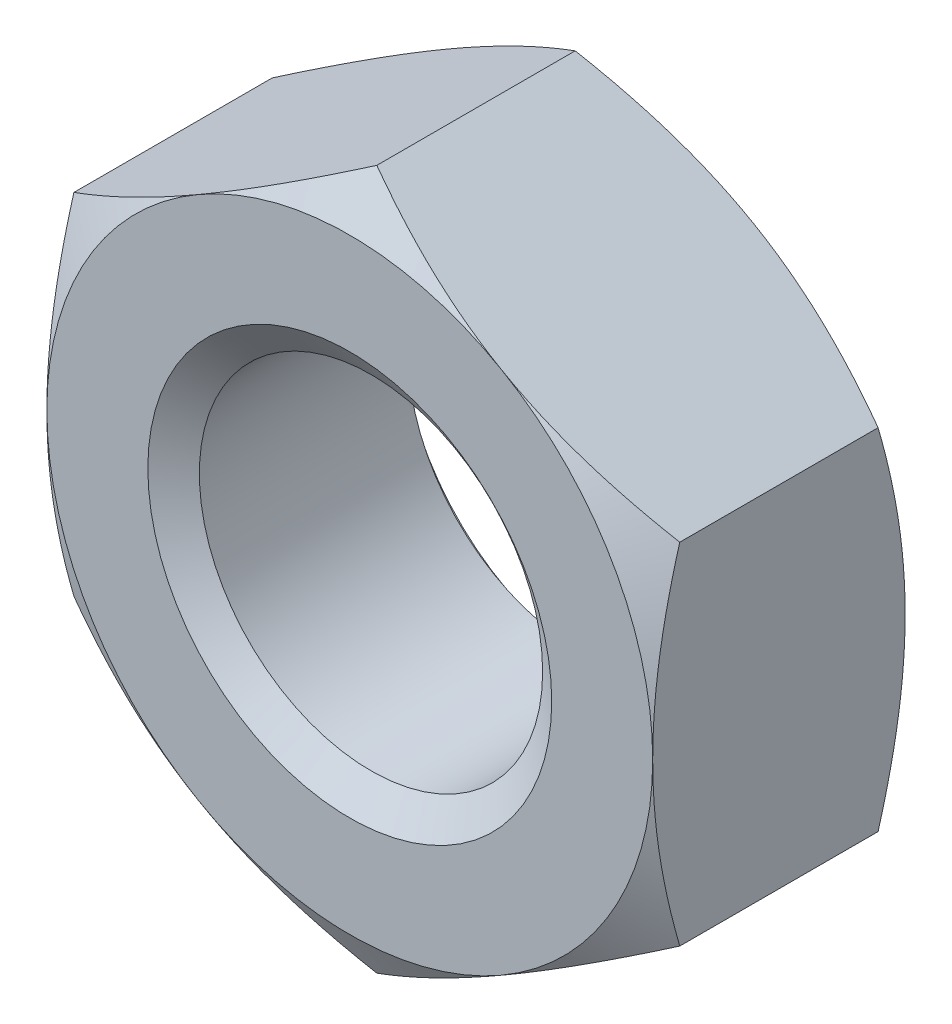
ISO-10303-21;
HEADER;
FILE_DESCRIPTION(('STEP AP214'),'2;1');
FILE_NAME('part.step','',(''),(''),'','','');
FILE_SCHEMA(('AUTOMOTIVE_DESIGN { 1 0 10303 214 1 1 1 1 }'));
ENDSEC;
DATA;
#1=APPLICATION_CONTEXT('core data for automotive mechanical design processes');
#2=APPLICATION_PROTOCOL_DEFINITION('international standard','automotive_design',2000,#1);
#3=PRODUCT_CONTEXT('',#1,'mechanical');
#4=PRODUCT('Part','Part','',(#3));
#5=PRODUCT_RELATED_PRODUCT_CATEGORY('part','',(#4));
#6=PRODUCT_DEFINITION_FORMATION('','',#4);
#7=PRODUCT_DEFINITION_CONTEXT('part definition',#1,'design');
#8=PRODUCT_DEFINITION('design','',#6,#7);
#9=PRODUCT_DEFINITION_SHAPE('','',#8);
#10=(LENGTH_UNIT() NAMED_UNIT(*) SI_UNIT(.MILLI.,.METRE.));
#11=(NAMED_UNIT(*) PLANE_ANGLE_UNIT() SI_UNIT($,.RADIAN.));
#12=(NAMED_UNIT(*) SI_UNIT($,.STERADIAN.) SOLID_ANGLE_UNIT());
#13=UNCERTAINTY_MEASURE_WITH_UNIT(LENGTH_MEASURE(1.E-05),#10,'distance_accuracy_value','');
#14=(GEOMETRIC_REPRESENTATION_CONTEXT(3) GLOBAL_UNCERTAINTY_ASSIGNED_CONTEXT((#13)) GLOBAL_UNIT_ASSIGNED_CONTEXT((#10,
#11,#12)) REPRESENTATION_CONTEXT('',''));
#15=CARTESIAN_POINT('',(0.,0.,0.));
#16=DIRECTION('',(0.,0.,1.));
#17=DIRECTION('',(1.,0.,0.));
#18=AXIS2_PLACEMENT_3D('',#15,#16,#17);
#19=CARTESIAN_POINT('',(-3.46944695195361E-13,-1.66533453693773E-13,-4.9999999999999));
#20=DIRECTION('',(0.,0.,1.));
#21=DIRECTION('',(1.00000000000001,0.,0.));
#22=AXIS2_PLACEMENT_3D('',#19,#20,#21);
#23=CYLINDRICAL_SURFACE('',#22,3.4);
#24=CARTESIAN_POINT('',(3.19189119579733E-13,-3.33066907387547E-13,-0.420124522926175));
#25=DIRECTION('',(0.,0.,1.));
#26=DIRECTION('',(1.00000000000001,0.,0.));
#27=AXIS2_PLACEMENT_3D('',#24,#25,#26);
#28=CIRCLE('',#27,3.4);
#29=CARTESIAN_POINT('',(3.40000000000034,-3.33255645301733E-13,-0.420124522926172));
#30=VERTEX_POINT('',#29);
#31=EDGE_CURVE('E174',#30,#30,#28,.F.);
#32=ORIENTED_EDGE('',*,*,#31,.F.);
#33=EDGE_LOOP('',(#32));
#34=FACE_BOUND('',#33,.T.);
#35=CARTESIAN_POINT('',(0.,0.,-4.55447547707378));
#36=DIRECTION('',(0.,0.,-1.));
#37=DIRECTION('',(-1.00000000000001,0.,0.));
#38=AXIS2_PLACEMENT_3D('',#35,#36,#37);
#39=CIRCLE('',#38,3.4);
#40=CARTESIAN_POINT('',(-3.40000000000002,0.,-4.55447547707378));
#41=VERTEX_POINT('',#40);
#42=EDGE_CURVE('E39',#41,#41,#39,.F.);
#43=ORIENTED_EDGE('',*,*,#42,.F.);
#44=EDGE_LOOP('',(#43));
#45=FACE_BOUND('',#44,.T.);
#46=ADVANCED_FACE('F34',(#34,#45),#23,.F.);
#47=CARTESIAN_POINT('',(0.,6.92820323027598,-4.99999999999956));
#48=DIRECTION('',(0.,0.,-1.));
#49=DIRECTION('',(-1.00000000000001,0.,0.));
#50=AXIS2_PLACEMENT_3D('',#47,#48,#49);
#51=PLANE('',#50);
#52=CARTESIAN_POINT('',(-3.46944695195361E-13,-1.66533453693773E-13,-4.9999999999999));
#53=DIRECTION('',(0.,0.,-1.));
#54=DIRECTION('',(-1.00000000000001,0.,0.));
#55=AXIS2_PLACEMENT_3D('',#52,#53,#54);
#56=CIRCLE('',#55,6.);
#57=CARTESIAN_POINT('',(-6.00000000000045,8.88178419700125E-13,-4.99999999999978));
#58=VERTEX_POINT('',#57);
#59=CARTESIAN_POINT('',(-3.00000000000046,-5.19615242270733,-4.99999999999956));
#60=VERTEX_POINT('',#59);
#61=EDGE_CURVE('E170',#58,#60,#56,.F.);
#62=ORIENTED_EDGE('',*,*,#61,.F.);
#63=CARTESIAN_POINT('',(-3.00000000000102,5.19615242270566,-4.99999999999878));
#64=VERTEX_POINT('',#63);
#65=EDGE_CURVE('E152',#64,#58,#56,.F.);
#66=ORIENTED_EDGE('',*,*,#65,.F.);
#67=CARTESIAN_POINT('',(2.99999999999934,5.19615242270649,-4.99999999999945));
#68=VERTEX_POINT('',#67);
#69=EDGE_CURVE('E169',#68,#64,#56,.F.);
#70=ORIENTED_EDGE('',*,*,#69,.F.);
#71=CARTESIAN_POINT('',(-3.46944695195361E-13,-1.66533453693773E-13,-4.9999999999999));
#72=DIRECTION('',(0.,0.,1.));
#73=DIRECTION('',(1.00000000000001,0.,0.));
#74=AXIS2_PLACEMENT_3D('',#71,#72,#73);
#75=CIRCLE('',#74,6.);
#76=CARTESIAN_POINT('',(6.,-1.11022302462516E-13,-4.99999999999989));
#77=VERTEX_POINT('',#76);
#78=EDGE_CURVE('E244',#77,#68,#75,.T.);
#79=ORIENTED_EDGE('',*,*,#78,.F.);
#80=CARTESIAN_POINT('',(3.0000000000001,-5.1961524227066,-4.9999999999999));
#81=VERTEX_POINT('',#80);
#82=EDGE_CURVE('E360',#81,#77,#56,.F.);
#83=ORIENTED_EDGE('',*,*,#82,.F.);
#84=EDGE_CURVE('E364',#60,#81,#56,.F.);
#85=ORIENTED_EDGE('',*,*,#84,.F.);
#86=EDGE_LOOP('',(#62,#66,#70,#79,#83,#85));
#87=FACE_BOUND('',#86,.T.);
#88=CARTESIAN_POINT('',(-3.46944695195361E-13,-1.66533453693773E-13,-4.9999999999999));
#89=DIRECTION('',(0.,0.,-1.));
#90=DIRECTION('',(-1.00000000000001,0.,0.));
#91=AXIS2_PLACEMENT_3D('',#88,#89,#90);
#92=CIRCLE('',#91,4.);
#93=CARTESIAN_POINT('',(-4.00000000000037,-1.66311409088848E-13,-4.9999999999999));
#94=VERTEX_POINT('',#93);
#95=EDGE_CURVE('E177',#94,#94,#92,.F.);
#96=ORIENTED_EDGE('',*,*,#95,.T.);
#97=EDGE_LOOP('',(#96));
#98=FACE_BOUND('',#97,.T.);
#99=ADVANCED_FACE('F297',(#87,#98),#51,.T.);
#100=CARTESIAN_POINT('',(-2.35922392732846E-13,6.9282032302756,7.70217223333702E-13));
#101=DIRECTION('',(0.,0.,-1.));
#102=DIRECTION('',(-1.00000000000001,0.,0.));
#103=AXIS2_PLACEMENT_3D('',#100,#101,#102);
#104=PLANE('',#103);
#105=CARTESIAN_POINT('',(0.,0.,0.));
#106=DIRECTION('',(0.,0.,-1.));
#107=DIRECTION('',(-1.00000000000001,0.,0.));
#108=AXIS2_PLACEMENT_3D('',#105,#106,#107);
#109=CIRCLE('',#108,6.);
#110=CARTESIAN_POINT('',(-5.99999999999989,2.77555756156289E-13,6.66133814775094E-13));
#111=VERTEX_POINT('',#110);
#112=CARTESIAN_POINT('',(-3.00000000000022,5.19615242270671,4.44089209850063E-13));
#113=VERTEX_POINT('',#112);
#114=EDGE_CURVE('E11',#111,#113,#109,.T.);
#115=ORIENTED_EDGE('',*,*,#114,.F.);
#116=CARTESIAN_POINT('',(-3.,-5.19615242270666,0.));
#117=VERTEX_POINT('',#116);
#118=EDGE_CURVE('E46',#117,#111,#109,.T.);
#119=ORIENTED_EDGE('',*,*,#118,.F.);
#120=CARTESIAN_POINT('',(3.,-5.19615242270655,1.11022302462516E-13));
#121=VERTEX_POINT('',#120);
#122=EDGE_CURVE('E173',#121,#117,#109,.T.);
#123=ORIENTED_EDGE('',*,*,#122,.F.);
#124=CARTESIAN_POINT('',(5.99999999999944,6.66133814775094E-13,3.2612801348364E-13));
#125=VERTEX_POINT('',#124);
#126=EDGE_CURVE('E351',#125,#121,#109,.T.);
#127=ORIENTED_EDGE('',*,*,#126,.F.);
#128=CARTESIAN_POINT('',(0.,0.,0.));
#129=DIRECTION('',(0.,0.,1.));
#130=DIRECTION('',(1.00000000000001,0.,0.));
#131=AXIS2_PLACEMENT_3D('',#128,#129,#130);
#132=CIRCLE('',#131,6.);
#133=CARTESIAN_POINT('',(3.00000000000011,5.19615242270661,0.));
#134=VERTEX_POINT('',#133);
#135=EDGE_CURVE('E128',#125,#134,#132,.T.);
#136=ORIENTED_EDGE('',*,*,#135,.T.);
#137=EDGE_CURVE('E44',#113,#134,#109,.T.);
#138=ORIENTED_EDGE('',*,*,#137,.F.);
#139=EDGE_LOOP('',(#115,#119,#123,#127,#136,#138));
#140=FACE_BOUND('',#139,.T.);
#141=CARTESIAN_POINT('',(0.,0.,0.));
#142=DIRECTION('',(0.,0.,1.));
#143=DIRECTION('',(1.00000000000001,0.,0.));
#144=AXIS2_PLACEMENT_3D('',#141,#142,#143);
#145=CIRCLE('',#144,4.);
#146=CARTESIAN_POINT('',(4.00000000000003,0.,0.));
#147=VERTEX_POINT('',#146);
#148=EDGE_CURVE('E176',#147,#147,#145,.T.);
#149=ORIENTED_EDGE('',*,*,#148,.F.);
#150=EDGE_LOOP('',(#149));
#151=FACE_BOUND('',#150,.T.);
#152=ADVANCED_FACE('F249',(#140,#151),#104,.F.);
#153=CARTESIAN_POINT('',(0.,6.92820323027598,-4.99999999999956));
#154=DIRECTION('',(-0.500000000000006,0.866025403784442,0.));
#155=DIRECTION('',(-0.866025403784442,-0.500000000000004,0.));
#156=AXIS2_PLACEMENT_3D('',#153,#154,#155);
#157=PLANE('',#156);
#158=DIRECTION('',(0.,0.,1.));
#159=VECTOR('',#158,1.);
#160=CARTESIAN_POINT('',(-6.00000000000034,3.46410161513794,-4.99999999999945));
#161=LINE('',#160,#159);
#162=CARTESIAN_POINT('',(-6.00000000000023,3.46410161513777,-4.464101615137));
#163=VERTEX_POINT('',#162);
#164=CARTESIAN_POINT('',(-6.00000000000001,3.46410161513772,-0.535898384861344));
#165=VERTEX_POINT('',#164);
#166=EDGE_CURVE('E164',#163,#165,#161,.T.);
#167=ORIENTED_EDGE('',*,*,#166,.T.);
#168=CARTESIAN_POINT('',(-6.0002000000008,3.46398614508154,-0.535965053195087));
#169=CARTESIAN_POINT('',(-5.86831298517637,3.54013114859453,-0.49200899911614));
#170=CARTESIAN_POINT('',(-5.73593423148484,3.61656005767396,-0.450047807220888));
#171=CARTESIAN_POINT('',(-5.4701016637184,3.77003856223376,-0.370664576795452));
#172=CARTESIAN_POINT('',(-5.33664741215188,3.84708841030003,-0.333244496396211));
#173=CARTESIAN_POINT('',(-4.9341478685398,4.07947163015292,-0.228530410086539));
#174=CARTESIAN_POINT('',(-4.66351376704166,4.2357223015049,-0.16897005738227));
#175=CARTESIAN_POINT('',(-4.25851475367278,4.46954859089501,-0.0991282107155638));
#176=CARTESIAN_POINT('',(-4.1253599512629,4.54642555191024,-0.0792322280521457));
#177=CARTESIAN_POINT('',(-3.85844867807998,4.70052684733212,-0.0458694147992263));
#178=CARTESIAN_POINT('',(-3.72469226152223,4.77775115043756,-0.0324020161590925));
#179=CARTESIAN_POINT('',(-3.45694711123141,4.93233388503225,-0.0122395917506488));
#180=CARTESIAN_POINT('',(-3.32295881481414,5.00969206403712,-0.00553688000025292));
#181=CARTESIAN_POINT('',(-3.05486583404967,5.16447561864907,0.000959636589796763));
#182=CARTESIAN_POINT('',(-2.92076115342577,5.24190099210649,0.000753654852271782));
#183=CARTESIAN_POINT('',(-2.55335498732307,5.45402304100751,-0.00930718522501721));
#184=CARTESIAN_POINT('',(-2.32017376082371,5.58865028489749,-0.0261978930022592));
#185=CARTESIAN_POINT('',(-1.8553600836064,5.85701058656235,-0.079759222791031));
#186=CARTESIAN_POINT('',(-1.62372926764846,5.99074270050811,-0.116448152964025));
#187=CARTESIAN_POINT('',(-1.15798010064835,6.25964310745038,-0.208160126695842));
#188=CARTESIAN_POINT('',(-0.923920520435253,6.39477746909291,-0.263571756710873));
#189=CARTESIAN_POINT('',(-0.45929191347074,6.663030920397,-0.389333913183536));
#190=CARTESIAN_POINT('',(-0.228716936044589,6.79615344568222,-0.459654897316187));
#191=CARTESIAN_POINT('',(0.000200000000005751,6.92831870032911,-0.535965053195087));
#192=B_SPLINE_CURVE_WITH_KNOTS('',3,(#168,#169,#170,#171,#172,#173,#174,#175,#176,#177,#178,
#179,#180,#181,#182,#183,#184,#185,#186,#187,#188,#189,#190,#191),.UNSPECIFIED.,.F.,.F.,(4,2,2,
2,2,2,2,2,2,2,2,4),(0.,0.475482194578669,0.951168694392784,1.90451835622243,2.36951738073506,
2.83447530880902,3.29890435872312,3.76331906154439,4.57182194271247,5.38107376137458,
6.20827406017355,7.03385036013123),.UNSPECIFIED.);
#193=EDGE_CURVE('E133',#165,#113,#192,.T.);
#194=ORIENTED_EDGE('',*,*,#193,.T.);
#195=CARTESIAN_POINT('',(-1.11022302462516E-13,6.92820323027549,-0.535898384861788));
#196=VERTEX_POINT('',#195);
#197=EDGE_CURVE('E53',#113,#196,#192,.T.);
#198=ORIENTED_EDGE('',*,*,#197,.T.);
#199=DIRECTION('',(0.,0.,1.));
#200=VECTOR('',#199,1.);
#201=CARTESIAN_POINT('',(0.,6.92820323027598,-4.99999999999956));
#202=LINE('',#201,#200);
#203=CARTESIAN_POINT('',(-2.22044604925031E-13,6.92820323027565,-4.46410161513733));
#204=VERTEX_POINT('',#203);
#205=EDGE_CURVE('E149',#204,#196,#202,.T.);
#206=ORIENTED_EDGE('',*,*,#205,.F.);
#207=CARTESIAN_POINT('',(-6.00020000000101,3.46398614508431,-4.46403494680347));
#208=CARTESIAN_POINT('',(-5.86831298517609,3.54013114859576,-4.50799100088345));
#209=CARTESIAN_POINT('',(-5.73593423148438,3.61656005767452,-4.54995219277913));
#210=CARTESIAN_POINT('',(-5.47010166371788,3.77003856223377,-4.62933542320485));
#211=CARTESIAN_POINT('',(-5.33664741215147,3.84708841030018,-4.66675550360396));
#212=CARTESIAN_POINT('',(-4.93414786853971,4.07947163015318,-4.77146958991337));
#213=CARTESIAN_POINT('',(-4.6635137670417,4.23572230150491,-4.83102994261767));
#214=CARTESIAN_POINT('',(-4.25851475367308,4.46954859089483,-4.90087178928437));
#215=CARTESIAN_POINT('',(-4.12535995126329,4.54642555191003,-4.92076777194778));
#216=CARTESIAN_POINT('',(-3.85844867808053,4.7005268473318,-4.95413058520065));
#217=CARTESIAN_POINT('',(-3.72469226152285,4.77775115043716,-4.96759798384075));
#218=CARTESIAN_POINT('',(-3.45694711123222,4.93233388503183,-4.98776040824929));
#219=CARTESIAN_POINT('',(-3.32295881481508,5.00969206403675,-4.99446311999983));
#220=CARTESIAN_POINT('',(-3.0548658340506,5.16447561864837,-5.00095963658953));
#221=CARTESIAN_POINT('',(-2.92076115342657,5.24190099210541,-5.00075365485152));
#222=CARTESIAN_POINT('',(-2.55335498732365,5.45402304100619,-4.99069281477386));
#223=CARTESIAN_POINT('',(-2.32017376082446,5.58865028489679,-4.97380210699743));
#224=CARTESIAN_POINT('',(-1.85536008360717,5.85701058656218,-4.92024077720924));
#225=CARTESIAN_POINT('',(-1.62372926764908,5.99074270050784,-4.88355184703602));
#226=CARTESIAN_POINT('',(-1.15798010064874,6.25964310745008,-4.79183987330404));
#227=CARTESIAN_POINT('',(-0.923920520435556,6.39477746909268,-4.73642824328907));
#228=CARTESIAN_POINT('',(-0.459291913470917,6.66303092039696,-4.61066608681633));
#229=CARTESIAN_POINT('',(-0.228716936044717,6.7961534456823,-4.54034510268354));
#230=CARTESIAN_POINT('',(0.000199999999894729,6.92831870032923,-4.46403494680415));
#231=B_SPLINE_CURVE_WITH_KNOTS('',3,(#207,#208,#209,#210,#211,#212,#213,#214,#215,#216,#217,
#218,#219,#220,#221,#222,#223,#224,#225,#226,#227,#228,#229,#230),.UNSPECIFIED.,.F.,.F.,(4,2,2,
2,2,2,2,2,2,2,2,4),(0.,0.475482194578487,0.95116869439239,1.90451835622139,2.36951738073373,
2.8344753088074,3.29890435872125,3.76331906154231,4.57182194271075,5.38107376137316,
6.20827406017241,7.03385036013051),.UNSPECIFIED.);
#232=EDGE_CURVE('E167',#64,#204,#231,.T.);
#233=ORIENTED_EDGE('',*,*,#232,.F.);
#234=EDGE_CURVE('E259',#163,#64,#231,.T.);
#235=ORIENTED_EDGE('',*,*,#234,.F.);
#236=EDGE_LOOP('',(#167,#194,#198,#206,#233,#235));
#237=FACE_BOUND('',#236,.T.);
#238=ADVANCED_FACE('F36',(#237),#157,.T.);
#239=CARTESIAN_POINT('',(6.00000000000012,3.46410161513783,-4.99999999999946));
#240=DIRECTION('',(0.500000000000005,0.866025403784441,0.));
#241=DIRECTION('',(-0.866025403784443,0.500000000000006,0.));
#242=AXIS2_PLACEMENT_3D('',#239,#240,#241);
#243=PLANE('',#242);
#244=ORIENTED_EDGE('',*,*,#205,.T.);
#245=CARTESIAN_POINT('',(-0.000200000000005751,6.92831870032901,-0.535965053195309));
#246=CARTESIAN_POINT('',(0.131687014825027,6.85217369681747,-0.492008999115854));
#247=CARTESIAN_POINT('',(0.264065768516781,6.77574478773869,-0.450047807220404));
#248=CARTESIAN_POINT('',(0.529898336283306,6.62226628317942,-0.37066457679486));
#249=CARTESIAN_POINT('',(0.6633525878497,6.54521643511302,-0.333244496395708));
#250=CARTESIAN_POINT('',(1.06585213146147,6.31283321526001,-0.228530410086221));
#251=CARTESIAN_POINT('',(1.33648623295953,6.15658254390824,-0.168970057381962));
#252=CARTESIAN_POINT('',(1.74148524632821,5.92275625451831,-0.0991282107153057));
#253=CARTESIAN_POINT('',(1.87464004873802,5.84587929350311,-0.0792322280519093));
#254=CARTESIAN_POINT('',(2.14155132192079,5.69177799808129,-0.045869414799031));
#255=CARTESIAN_POINT('',(2.27530773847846,5.61455369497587,-0.0324020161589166));
#256=CARTESIAN_POINT('',(2.54305288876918,5.45997096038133,-0.0122395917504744));
#257=CARTESIAN_POINT('',(2.67704118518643,5.3826127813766,-0.00553688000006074));
#258=CARTESIAN_POINT('',(2.94513416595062,5.22782922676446,0.000959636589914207));
#259=CARTESIAN_POINT('',(3.07923884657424,5.15040385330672,0.00075365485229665));
#260=CARTESIAN_POINT('',(3.44664501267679,4.9382818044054,-0.00930718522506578));
#261=CARTESIAN_POINT('',(3.67982623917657,4.80365456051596,-0.0261978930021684));
#262=CARTESIAN_POINT('',(4.14463991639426,4.53529425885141,-0.0797592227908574));
#263=CARTESIAN_POINT('',(4.37627073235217,4.40156214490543,-0.116448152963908));
#264=CARTESIAN_POINT('',(4.84201989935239,4.13266173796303,-0.208160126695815));
#265=CARTESIAN_POINT('',(5.07607947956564,3.9975273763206,-0.26357175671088));
#266=CARTESIAN_POINT('',(5.54070808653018,3.7292739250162,-0.389333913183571));
#267=CARTESIAN_POINT('',(5.77128306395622,3.59615139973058,-0.459654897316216));
#268=CARTESIAN_POINT('',(6.00020000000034,3.46398614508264,-0.53596505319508));
#269=B_SPLINE_CURVE_WITH_KNOTS('',3,(#245,#246,#247,#248,#249,#250,#251,#252,#253,#254,#255,
#256,#257,#258,#259,#260,#261,#262,#263,#264,#265,#266,#267,#268),.UNSPECIFIED.,.F.,.F.,(4,2,2,
2,2,2,2,2,2,2,2,4),(0.,0.475482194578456,0.951168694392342,1.90451835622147,2.36951738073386,
2.83447530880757,3.29890435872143,3.76331906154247,4.57182194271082,5.38107376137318,
6.20827406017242,7.03385036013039),.UNSPECIFIED.);
#270=EDGE_CURVE('E143',#196,#134,#269,.T.);
#271=ORIENTED_EDGE('',*,*,#270,.T.);
#272=CARTESIAN_POINT('',(5.99999999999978,3.46410161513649,-0.535898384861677));
#273=VERTEX_POINT('',#272);
#274=EDGE_CURVE('E60',#134,#273,#269,.T.);
#275=ORIENTED_EDGE('',*,*,#274,.T.);
#276=DIRECTION('',(0.,0.,1.));
#277=VECTOR('',#276,1.);
#278=CARTESIAN_POINT('',(6.00000000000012,3.46410161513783,-4.99999999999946));
#279=LINE('',#278,#277);
#280=CARTESIAN_POINT('',(5.99999999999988,3.46410161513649,-4.46410161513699));
#281=VERTEX_POINT('',#280);
#282=EDGE_CURVE('E142',#281,#273,#279,.T.);
#283=ORIENTED_EDGE('',*,*,#282,.F.);
#284=CARTESIAN_POINT('',(-0.000200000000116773,6.92831870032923,-4.46403494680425));
#285=CARTESIAN_POINT('',(0.131687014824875,6.85217369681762,-4.50799100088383));
#286=CARTESIAN_POINT('',(0.26406576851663,6.7757447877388,-4.54995219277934));
#287=CARTESIAN_POINT('',(0.529898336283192,6.62226628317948,-4.62933542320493));
#288=CARTESIAN_POINT('',(0.663352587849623,6.54521643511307,-4.66675550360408));
#289=CARTESIAN_POINT('',(1.06585213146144,6.31283321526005,-4.77146958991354));
#290=CARTESIAN_POINT('',(1.3364862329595,6.15658254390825,-4.8310299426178));
#291=CARTESIAN_POINT('',(1.74148524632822,5.92275625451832,-4.90087178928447));
#292=CARTESIAN_POINT('',(1.87464004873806,5.84587929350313,-4.92076777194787));
#293=CARTESIAN_POINT('',(2.14155132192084,5.69177799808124,-4.95413058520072));
#294=CARTESIAN_POINT('',(2.2753077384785,5.61455369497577,-4.96759798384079));
#295=CARTESIAN_POINT('',(2.54305288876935,5.45997096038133,-4.98776040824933));
#296=CARTESIAN_POINT('',(2.67704118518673,5.38261278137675,-4.99446311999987));
#297=CARTESIAN_POINT('',(2.9451341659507,5.2278292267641,-5.00095963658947));
#298=CARTESIAN_POINT('',(3.07923884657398,5.15040385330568,-5.00075365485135));
#299=CARTESIAN_POINT('',(3.44664501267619,4.93828180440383,-4.99069281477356));
#300=CARTESIAN_POINT('',(3.67982623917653,4.80365456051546,-4.97380210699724));
#301=CARTESIAN_POINT('',(4.14463991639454,4.53529425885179,-4.92024077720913));
#302=CARTESIAN_POINT('',(4.37627073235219,4.40156214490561,-4.88355184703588));
#303=CARTESIAN_POINT('',(4.84201989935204,4.13266173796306,-4.79183987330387));
#304=CARTESIAN_POINT('',(5.07607947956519,3.99752737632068,-4.73642824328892));
#305=CARTESIAN_POINT('',(5.54070808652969,3.72927392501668,-4.61066608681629));
#306=CARTESIAN_POINT('',(5.77128306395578,3.59615139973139,-4.54034510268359));
#307=CARTESIAN_POINT('',(6.0002,3.46398614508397,-4.46403494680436));
#308=B_SPLINE_CURVE_WITH_KNOTS('',3,(#284,#285,#286,#287,#288,#289,#290,#291,#292,#293,#294,
#295,#296,#297,#298,#299,#300,#301,#302,#303,#304,#305,#306,#307),.UNSPECIFIED.,.F.,.F.,(4,2,2,
2,2,2,2,2,2,2,2,4),(0.,0.47548219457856,0.951168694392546,1.90451835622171,2.36951738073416,
2.83447530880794,3.2989043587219,3.76331906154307,4.57182194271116,5.38107376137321,
6.20827406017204,7.03385036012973),.UNSPECIFIED.);
#309=EDGE_CURVE('E253',#68,#281,#308,.T.);
#310=ORIENTED_EDGE('',*,*,#309,.F.);
#311=EDGE_CURVE('E258',#204,#68,#308,.T.);
#312=ORIENTED_EDGE('',*,*,#311,.F.);
#313=EDGE_LOOP('',(#244,#271,#275,#283,#310,#312));
#314=FACE_BOUND('',#313,.T.);
#315=ADVANCED_FACE('F140',(#314),#243,.T.);
#316=CARTESIAN_POINT('',(6.00000000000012,3.46410161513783,-4.99999999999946));
#317=DIRECTION('',(-1.00000000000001,0.,0.));
#318=DIRECTION('',(0.,-1.,0.));
#319=AXIS2_PLACEMENT_3D('',#316,#317,#318);
#320=PLANE('',#319);
#321=CARTESIAN_POINT('',(5.99999999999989,-9.18730798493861,-2.87116023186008));
#322=CARTESIAN_POINT('',(6.00000000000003,-8.92387405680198,-2.74385440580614));
#323=CARTESIAN_POINT('',(6.00000000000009,-8.65981728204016,-2.61781410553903));
#324=CARTESIAN_POINT('',(6.00000000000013,-8.13012127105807,-2.36898772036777));
#325=CARTESIAN_POINT('',(6.00000000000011,-7.86448177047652,-2.24620219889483));
#326=CARTESIAN_POINT('',(6.0000000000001,-7.32984857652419,-2.00396169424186));
#327=CARTESIAN_POINT('',(6.00000000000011,-7.06084438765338,-1.88452979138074));
#328=CARTESIAN_POINT('',(6.00000000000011,-6.52062501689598,-1.65079587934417));
#329=CARTESIAN_POINT('',(6.00000000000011,-6.24940995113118,-1.5364936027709));
#330=CARTESIAN_POINT('',(6.00000000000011,-5.70097061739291,-1.31302597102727));
#331=CARTESIAN_POINT('',(6.00000000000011,-5.4237134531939,-1.20394090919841));
#332=CARTESIAN_POINT('',(6.00000000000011,-4.86592864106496,-0.994314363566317));
#333=CARTESIAN_POINT('',(6.00000000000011,-4.58540063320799,-0.893773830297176));
#334=CARTESIAN_POINT('',(6.00000000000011,-4.02120500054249,-0.703937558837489));
#335=CARTESIAN_POINT('',(6.00000000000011,-3.73754550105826,-0.614617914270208));
#336=CARTESIAN_POINT('',(6.00000000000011,-3.16619097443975,-0.450125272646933));
#337=CARTESIAN_POINT('',(6.0000000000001,-2.8784972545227,-0.374947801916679));
#338=CARTESIAN_POINT('',(6.0000000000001,-2.29889164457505,-0.242385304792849));
#339=CARTESIAN_POINT('',(6.00000000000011,-2.00697865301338,-0.185005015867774));
#340=CARTESIAN_POINT('',(6.00000000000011,-1.41959231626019,-0.0919146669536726));
#341=CARTESIAN_POINT('',(6.00000000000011,-1.1241189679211,-0.0562046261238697));
#342=CARTESIAN_POINT('',(6.00000000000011,-0.680438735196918,-0.0211814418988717));
#343=CARTESIAN_POINT('',(6.00000000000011,-0.532926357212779,-0.0125955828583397));
#344=CARTESIAN_POINT('',(6.00000000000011,-0.23766360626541,-0.00167454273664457));
#345=CARTESIAN_POINT('',(6.00000000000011,-0.0899132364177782,0.000660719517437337));
#346=CARTESIAN_POINT('',(6.00000000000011,0.205509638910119,-0.000982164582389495));
#347=CARTESIAN_POINT('',(6.00000000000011,0.353182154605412,-0.00495853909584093));
#348=CARTESIAN_POINT('',(6.00000000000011,0.648231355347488,-0.0191239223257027));
#349=CARTESIAN_POINT('',(6.00000000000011,0.795608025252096,-0.0293132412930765));
#350=CARTESIAN_POINT('',(6.00000000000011,1.15280356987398,-0.0613263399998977));
#351=CARTESIAN_POINT('',(6.00000000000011,1.36234795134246,-0.0862632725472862));
#352=CARTESIAN_POINT('',(6.00000000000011,1.7798310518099,-0.147313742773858));
#353=CARTESIAN_POINT('',(6.00000000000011,1.987769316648,-0.183430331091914));
#354=CARTESIAN_POINT('',(6.00000000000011,2.40186856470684,-0.265559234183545));
#355=CARTESIAN_POINT('',(6.00000000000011,2.60802767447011,-0.31158090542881));
#356=CARTESIAN_POINT('',(6.00000000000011,3.01822481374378,-0.412115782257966));
#357=CARTESIAN_POINT('',(6.00000000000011,3.2222630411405,-0.466628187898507));
#358=CARTESIAN_POINT('',(6.00000000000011,3.63324382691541,-0.584265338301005));
#359=CARTESIAN_POINT('',(6.00000000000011,3.84013498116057,-0.647568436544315));
#360=CARTESIAN_POINT('',(6.00000000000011,4.25173044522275,-0.78042934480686));
#361=CARTESIAN_POINT('',(6.00000000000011,4.45643615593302,-0.849982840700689));
#362=CARTESIAN_POINT('',(6.00000000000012,4.86283932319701,-0.993907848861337));
#363=CARTESIAN_POINT('',(6.00000000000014,5.06454722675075,-1.06825003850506));
#364=CARTESIAN_POINT('',(6.00000000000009,5.46639806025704,-1.22129788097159));
#365=CARTESIAN_POINT('',(6.00000000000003,5.66654031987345,-1.30000529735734));
#366=CARTESIAN_POINT('',(5.99999999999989,5.86595548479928,-1.38046350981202));
#367=B_SPLINE_CURVE_WITH_KNOTS('',3,(#321,#322,#323,#324,#325,#326,#327,#328,#329,#330,#331,
#332,#333,#334,#335,#336,#337,#338,#339,#340,#341,#342,#343,#344,#345,#346,#347,#348,#349,#350,
#351,#352,#353,#354,#355,#356,#357,#358,#359,#360,#361,#362,#363,#364,#365,#366),.UNSPECIFIED.,
.F.,.F.,(4,2,2,2,2,2,2,2,2,2,2,2,2,2,2,2,2,2,2,2,2,2,4),(0.,0.877757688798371,1.75566634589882,
2.63859891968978,3.52148541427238,4.41521101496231,5.30903590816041,6.20092297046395,
7.09252742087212,7.98436900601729,8.8762113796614,9.31938497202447,9.76255280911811,
10.2055962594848,10.6486618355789,11.2813783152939,11.9142675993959,12.5477573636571,
13.1811874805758,13.8301443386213,14.4786566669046,15.1235187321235,15.7686432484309),.UNSPECIFIED.);
#368=CARTESIAN_POINT('',(5.99999999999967,-3.46410161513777,-0.535898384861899));
#369=VERTEX_POINT('',#368);
#370=EDGE_CURVE('E135',#369,#125,#367,.T.);
#371=ORIENTED_EDGE('',*,*,#370,.F.);
#372=DIRECTION('',(0.,0.,1.));
#373=VECTOR('',#372,1.);
#374=CARTESIAN_POINT('',(5.99999999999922,-3.46410161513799,-4.99999999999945));
#375=LINE('',#374,#373);
#376=CARTESIAN_POINT('',(6.00000000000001,-3.46410161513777,-4.46410161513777));
#377=VERTEX_POINT('',#376);
#378=EDGE_CURVE('E150',#377,#369,#375,.T.);
#379=ORIENTED_EDGE('',*,*,#378,.F.);
#380=CARTESIAN_POINT('',(5.99999999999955,-9.18730798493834,-2.12883976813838));
#381=CARTESIAN_POINT('',(5.99999999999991,-8.92387405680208,-2.25614559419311));
#382=CARTESIAN_POINT('',(6.00000000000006,-8.65981728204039,-2.38218589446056));
#383=CARTESIAN_POINT('',(6.00000000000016,-8.13012127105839,-2.63101227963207));
#384=CARTESIAN_POINT('',(6.00000000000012,-7.86448177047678,-2.75379780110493));
#385=CARTESIAN_POINT('',(6.0000000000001,-7.32984857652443,-2.99603830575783));
#386=CARTESIAN_POINT('',(6.00000000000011,-7.06084438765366,-3.11547020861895));
#387=CARTESIAN_POINT('',(6.00000000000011,-6.52062501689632,-3.34920412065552));
#388=CARTESIAN_POINT('',(6.00000000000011,-6.24940995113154,-3.46350639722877));
#389=CARTESIAN_POINT('',(6.00000000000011,-5.70097061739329,-3.68697402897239));
#390=CARTESIAN_POINT('',(6.00000000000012,-5.4237134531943,-3.79605909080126));
#391=CARTESIAN_POINT('',(6.0000000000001,-4.86592864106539,-4.00568563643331));
#392=CARTESIAN_POINT('',(6.00000000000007,-4.58540063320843,-4.10622616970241));
#393=CARTESIAN_POINT('',(6.00000000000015,-4.02120500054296,-4.29606244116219));
#394=CARTESIAN_POINT('',(6.00000000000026,-3.73754550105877,-4.38538208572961));
#395=CARTESIAN_POINT('',(5.99999999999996,-3.16619097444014,-4.54987472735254));
#396=CARTESIAN_POINT('',(5.99999999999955,-2.87849725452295,-4.62505219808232));
#397=CARTESIAN_POINT('',(5.99999999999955,-2.29889164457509,-4.75761469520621));
#398=CARTESIAN_POINT('',(5.99999999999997,-2.00697865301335,-4.8149949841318));
#399=CARTESIAN_POINT('',(6.00000000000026,-1.41959231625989,-4.90808533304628));
#400=CARTESIAN_POINT('',(6.00000000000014,-1.12411896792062,-4.94379537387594));
#401=CARTESIAN_POINT('',(6.0000000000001,-0.680438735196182,-4.97881855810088));
#402=CARTESIAN_POINT('',(6.00000000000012,-0.532926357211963,-4.98740441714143));
#403=CARTESIAN_POINT('',(6.00000000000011,-0.237663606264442,-4.99832545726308));
#404=CARTESIAN_POINT('',(6.0000000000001,-0.0899132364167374,-5.00066071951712));
#405=CARTESIAN_POINT('',(6.00000000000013,0.205509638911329,-4.99901783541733));
#406=CARTESIAN_POINT('',(6.00000000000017,0.353182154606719,-4.99504146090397));
#407=CARTESIAN_POINT('',(6.00000000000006,0.648231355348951,-4.98087607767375));
#408=CARTESIAN_POINT('',(5.99999999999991,0.795608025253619,-4.97068675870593));
#409=CARTESIAN_POINT('',(5.99999999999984,1.15280356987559,-4.93867365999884));
#410=CARTESIAN_POINT('',(6.00000000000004,1.36234795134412,-4.91373672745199));
#411=CARTESIAN_POINT('',(6.00000000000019,1.77983105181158,-4.85268625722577));
#412=CARTESIAN_POINT('',(6.00000000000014,1.98776931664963,-4.81656966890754));
#413=CARTESIAN_POINT('',(6.0000000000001,2.40186856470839,-4.73444076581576));
#414=CARTESIAN_POINT('',(6.00000000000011,2.60802767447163,-4.68841909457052));
#415=CARTESIAN_POINT('',(6.00000000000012,3.01822481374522,-4.58788421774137));
#416=CARTESIAN_POINT('',(6.00000000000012,3.22226304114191,-4.53337181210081));
#417=CARTESIAN_POINT('',(6.00000000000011,3.63324382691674,-4.41573466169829));
#418=CARTESIAN_POINT('',(6.00000000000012,3.84013498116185,-4.35243156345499));
#419=CARTESIAN_POINT('',(6.00000000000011,4.25173044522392,-4.21957065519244));
#420=CARTESIAN_POINT('',(6.00000000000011,4.45643615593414,-4.1500171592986));
#421=CARTESIAN_POINT('',(6.00000000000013,4.8628393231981,-4.006092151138));
#422=CARTESIAN_POINT('',(6.00000000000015,5.06454722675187,-3.93174996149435));
#423=CARTESIAN_POINT('',(6.00000000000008,5.46639806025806,-3.77870211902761));
#424=CARTESIAN_POINT('',(6.,5.66654031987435,-3.69999470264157));
#425=CARTESIAN_POINT('',(5.99999999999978,5.8659554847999,-3.6195364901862));
#426=B_SPLINE_CURVE_WITH_KNOTS('',3,(#380,#381,#382,#383,#384,#385,#386,#387,#388,#389,#390,
#391,#392,#393,#394,#395,#396,#397,#398,#399,#400,#401,#402,#403,#404,#405,#406,#407,#408,#409,
#410,#411,#412,#413,#414,#415,#416,#417,#418,#419,#420,#421,#422,#423,#424,#425),.UNSPECIFIED.,
.F.,.F.,(4,2,2,2,2,2,2,2,2,2,2,2,2,2,2,2,2,2,2,2,2,2,4),(0.,0.877757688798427,1.75566634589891,
2.63859891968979,3.52148541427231,4.41521101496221,5.30903590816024,6.20092297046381,
7.09252742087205,7.98436900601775,8.87621137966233,9.31938497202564,9.76255280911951,
10.2055962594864,10.6486618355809,11.2813783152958,11.9142675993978,12.5477573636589,
13.1811874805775,13.8301443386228,14.478656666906,15.1235187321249,15.7686432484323),.UNSPECIFIED.);
#427=EDGE_CURVE('E265',#377,#77,#426,.T.);
#428=ORIENTED_EDGE('',*,*,#427,.T.);
#429=EDGE_CURVE('E148',#77,#281,#426,.T.);
#430=ORIENTED_EDGE('',*,*,#429,.T.);
#431=ORIENTED_EDGE('',*,*,#282,.T.);
#432=EDGE_CURVE('E125',#125,#273,#367,.T.);
#433=ORIENTED_EDGE('',*,*,#432,.F.);
#434=EDGE_LOOP('',(#371,#379,#428,#430,#431,#433));
#435=FACE_BOUND('',#434,.T.);
#436=ADVANCED_FACE('F146',(#435),#320,.F.);
#437=CARTESIAN_POINT('',(0.,-6.92820323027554,-4.99999999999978));
#438=DIRECTION('',(0.500000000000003,-0.866025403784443,0.));
#439=DIRECTION('',(0.866025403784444,0.500000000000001,0.));
#440=AXIS2_PLACEMENT_3D('',#437,#438,#439);
#441=PLANE('',#440);
#442=ORIENTED_EDGE('',*,*,#378,.T.);
#443=CARTESIAN_POINT('',(6.0002,-3.46398614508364,-0.535965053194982));
#444=CARTESIAN_POINT('',(5.86831298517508,-3.54013114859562,-0.492008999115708));
#445=CARTESIAN_POINT('',(5.73593423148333,-3.61656005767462,-0.450047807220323));
#446=CARTESIAN_POINT('',(5.47010166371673,-3.7700385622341,-0.370664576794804));
#447=CARTESIAN_POINT('',(5.33664741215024,-3.84708841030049,-0.333244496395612));
#448=CARTESIAN_POINT('',(4.93414786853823,-4.07947163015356,-0.228530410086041));
#449=CARTESIAN_POINT('',(4.66351376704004,-4.23572230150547,-0.168970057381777));
#450=CARTESIAN_POINT('',(4.25851475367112,-4.46954859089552,-0.0991282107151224));
#451=CARTESIAN_POINT('',(4.12535995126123,-4.54642555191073,-0.079232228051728));
#452=CARTESIAN_POINT('',(3.85844867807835,-4.70052684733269,-0.0458694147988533));
#453=CARTESIAN_POINT('',(3.72469226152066,-4.77775115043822,-0.0324020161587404));
#454=CARTESIAN_POINT('',(3.45694711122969,-4.93233388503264,-0.0122395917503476));
#455=CARTESIAN_POINT('',(3.32295881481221,-5.00969206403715,-0.00553687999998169));
#456=CARTESIAN_POINT('',(3.05486583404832,-5.16447561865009,0.000959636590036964));
#457=CARTESIAN_POINT('',(2.9207611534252,-5.24190099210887,0.000753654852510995));
#458=CARTESIAN_POINT('',(2.55335498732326,-5.45402304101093,-0.00930718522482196));
#459=CARTESIAN_POINT('',(2.32017376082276,-5.58865028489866,-0.0261978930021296));
#460=CARTESIAN_POINT('',(1.85536008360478,-5.8570105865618,-0.0797592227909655));
#461=CARTESIAN_POINT('',(1.6237292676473,-5.99074270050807,-0.116448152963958));
#462=CARTESIAN_POINT('',(1.15798010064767,-6.25964310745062,-0.208160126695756));
#463=CARTESIAN_POINT('',(0.923920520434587,-6.39477746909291,-0.26357175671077));
#464=CARTESIAN_POINT('',(0.459291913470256,-6.66303092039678,-0.389333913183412));
#465=CARTESIAN_POINT('',(0.22871693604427,-6.79615344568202,-0.459654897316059));
#466=CARTESIAN_POINT('',(-0.000199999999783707,-6.92831870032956,-0.535965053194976));
#467=B_SPLINE_CURVE_WITH_KNOTS('',3,(#443,#444,#445,#446,#447,#448,#449,#450,#451,#452,#453,
#454,#455,#456,#457,#458,#459,#460,#461,#462,#463,#464,#465,#466),.UNSPECIFIED.,.F.,.F.,(4,2,2,
2,2,2,2,2,2,2,2,4),(0.,0.475482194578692,0.95116869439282,1.90451835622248,2.36951738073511,
2.83447530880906,3.29890435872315,3.76331906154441,4.57182194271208,5.38107376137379,
6.20827406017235,7.03385036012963),.UNSPECIFIED.);
#468=EDGE_CURVE('E346',#369,#121,#467,.T.);
#469=ORIENTED_EDGE('',*,*,#468,.T.);
#470=CARTESIAN_POINT('',(-8.88178419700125E-13,-6.92820323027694,-0.535898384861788));
#471=VERTEX_POINT('',#470);
#472=EDGE_CURVE('E225',#121,#471,#467,.T.);
#473=ORIENTED_EDGE('',*,*,#472,.T.);
#474=DIRECTION('',(0.,0.,1.));
#475=VECTOR('',#474,1.);
#476=CARTESIAN_POINT('',(0.,-6.92820323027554,-4.99999999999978));
#477=LINE('',#476,#475);
#478=CARTESIAN_POINT('',(2.08166817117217E-13,-6.92820323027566,-4.46410161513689));
#479=VERTEX_POINT('',#478);
#480=EDGE_CURVE('E155',#479,#471,#477,.T.);
#481=ORIENTED_EDGE('',*,*,#480,.F.);
#482=CARTESIAN_POINT('',(6.00019999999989,-3.46398614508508,-4.46403494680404));
#483=CARTESIAN_POINT('',(5.86831298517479,-3.54013114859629,-4.50799100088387));
#484=CARTESIAN_POINT('',(5.735934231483,-3.61656005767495,-4.54995219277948));
#485=CARTESIAN_POINT('',(5.47010166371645,-3.77003856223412,-4.62933542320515));
#486=CARTESIAN_POINT('',(5.33664741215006,-3.84708841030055,-4.66675550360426));
#487=CARTESIAN_POINT('',(4.93414786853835,-4.07947163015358,-4.77146958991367));
#488=CARTESIAN_POINT('',(4.66351376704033,-4.23572230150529,-4.83102994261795));
#489=CARTESIAN_POINT('',(4.25851475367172,-4.46954859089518,-4.90087178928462));
#490=CARTESIAN_POINT('',(4.12535995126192,-4.54642555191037,-4.92076777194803));
#491=CARTESIAN_POINT('',(3.85844867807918,-4.70052684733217,-4.95413058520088));
#492=CARTESIAN_POINT('',(3.72469226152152,-4.77775115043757,-4.96759798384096));
#493=CARTESIAN_POINT('',(3.45694711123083,-4.93233388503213,-4.98776040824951));
#494=CARTESIAN_POINT('',(3.32295881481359,-5.00969206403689,-4.99446312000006));
#495=CARTESIAN_POINT('',(3.05486583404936,-5.16447561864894,-5.00095963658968));
#496=CARTESIAN_POINT('',(2.92076115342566,-5.24190099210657,-5.00075365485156));
#497=CARTESIAN_POINT('',(2.5533549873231,-5.45402304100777,-4.9906928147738));
#498=CARTESIAN_POINT('',(2.32017376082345,-5.58865028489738,-4.97380210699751));
#499=CARTESIAN_POINT('',(1.85536008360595,-5.857010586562,-4.92024077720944));
#500=CARTESIAN_POINT('',(1.62372926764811,-5.99074270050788,-4.88355184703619));
#501=CARTESIAN_POINT('',(1.15798010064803,-6.25964310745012,-4.7918398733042));
#502=CARTESIAN_POINT('',(0.923920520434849,-6.3947774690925,-4.73642824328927));
#503=CARTESIAN_POINT('',(0.459291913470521,-6.66303092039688,-4.61066608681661));
#504=CARTESIAN_POINT('',(0.22871693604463,-6.79615344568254,-4.54034510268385));
#505=CARTESIAN_POINT('',(-0.000199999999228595,-6.92831870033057,-4.46403494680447));
#506=B_SPLINE_CURVE_WITH_KNOTS('',3,(#482,#483,#484,#485,#486,#487,#488,#489,#490,#491,#492,
#493,#494,#495,#496,#497,#498,#499,#500,#501,#502,#503,#504,#505),.UNSPECIFIED.,.F.,.F.,(4,2,2,
2,2,2,2,2,2,2,2,4),(0.,0.475482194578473,0.951168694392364,1.90451835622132,2.36951738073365,
2.83447530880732,3.29890435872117,3.76331906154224,4.57182194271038,5.38107376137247,
6.20827406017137,7.03385036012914),.UNSPECIFIED.);
#507=EDGE_CURVE('E271',#81,#479,#506,.T.);
#508=ORIENTED_EDGE('',*,*,#507,.F.);
#509=EDGE_CURVE('E270',#377,#81,#506,.T.);
#510=ORIENTED_EDGE('',*,*,#509,.F.);
#511=EDGE_LOOP('',(#442,#469,#473,#481,#508,#510));
#512=FACE_BOUND('',#511,.T.);
#513=ADVANCED_FACE('F281',(#512),#441,.T.);
#514=CARTESIAN_POINT('',(-6.00000000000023,-3.46410161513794,-4.99999999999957));
#515=DIRECTION('',(-0.500000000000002,-0.866025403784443,0.));
#516=DIRECTION('',(0.866025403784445,-0.500000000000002,0.));
#517=AXIS2_PLACEMENT_3D('',#514,#515,#516);
#518=PLANE('',#517);
#519=ORIENTED_EDGE('',*,*,#480,.T.);
#520=CARTESIAN_POINT('',(0.000200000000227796,-6.92831870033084,-0.535965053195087));
#521=CARTESIAN_POINT('',(-0.131687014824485,-6.85217369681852,-0.492008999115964));
#522=CARTESIAN_POINT('',(-0.264065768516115,-6.77574478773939,-0.450047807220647));
#523=CARTESIAN_POINT('',(-0.529898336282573,-6.62226628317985,-0.370664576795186));
#524=CARTESIAN_POINT('',(-0.663352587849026,-6.54521643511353,-0.333244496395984));
#525=CARTESIAN_POINT('',(-1.06585213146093,-6.3128332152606,-0.228530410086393));
#526=CARTESIAN_POINT('',(-1.33648623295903,-6.15658254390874,-0.168970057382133));
#527=CARTESIAN_POINT('',(-1.74148524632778,-5.92275625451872,-0.0991282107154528));
#528=CARTESIAN_POINT('',(-1.87464004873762,-5.8458792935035,-0.0792322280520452));
#529=CARTESIAN_POINT('',(-2.14155132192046,-5.69177799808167,-0.0458694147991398));
#530=CARTESIAN_POINT('',(-2.27530773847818,-5.61455369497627,-0.0324020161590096));
#531=CARTESIAN_POINT('',(-2.5430528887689,-5.45997096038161,-0.0122395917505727));
#532=CARTESIAN_POINT('',(-2.6770411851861,-5.38261278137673,-0.00553688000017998));
#533=CARTESIAN_POINT('',(-2.94513416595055,-5.22782922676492,0.00095963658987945));
#534=CARTESIAN_POINT('',(-3.07923884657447,-5.15040385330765,0.000753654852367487));
#535=CARTESIAN_POINT('',(-3.44664501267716,-4.93828180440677,-0.00930718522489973));
#536=CARTESIAN_POINT('',(-3.67982623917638,-4.80365456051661,-0.0261978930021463));
#537=CARTESIAN_POINT('',(-4.14463991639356,-4.53529425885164,-0.0797592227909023));
#538=CARTESIAN_POINT('',(-4.3762707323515,-4.40156214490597,-0.116448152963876));
#539=CARTESIAN_POINT('',(-4.84201989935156,-4.13266173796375,-0.208160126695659));
#540=CARTESIAN_POINT('',(-5.0760794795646,-3.99752737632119,-0.263571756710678));
#541=CARTESIAN_POINT('',(-5.54070808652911,-3.72927392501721,-0.389333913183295));
#542=CARTESIAN_POINT('',(-5.77128306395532,-3.59615139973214,-0.459654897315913));
#543=CARTESIAN_POINT('',(-6.00020000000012,-3.46398614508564,-0.535965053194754));
#544=B_SPLINE_CURVE_WITH_KNOTS('',3,(#520,#521,#522,#523,#524,#525,#526,#527,#528,#529,#530,
#531,#532,#533,#534,#535,#536,#537,#538,#539,#540,#541,#542,#543),.UNSPECIFIED.,.F.,.F.,(4,2,2,
2,2,2,2,2,2,2,2,4),(0.,0.47548219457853,0.951168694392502,1.90451835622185,2.36951738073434,
2.83447530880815,3.29890435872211,3.76331906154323,4.5718219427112,5.38107376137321,
6.20827406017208,7.03385036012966),.UNSPECIFIED.);
#545=EDGE_CURVE('E344',#471,#117,#544,.T.);
#546=ORIENTED_EDGE('',*,*,#545,.T.);
#547=CARTESIAN_POINT('',(-6.00000000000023,-3.46410161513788,-0.535898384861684));
#548=VERTEX_POINT('',#547);
#549=EDGE_CURVE('E199',#117,#548,#544,.T.);
#550=ORIENTED_EDGE('',*,*,#549,.T.);
#551=DIRECTION('',(0.,0.,1.));
#552=VECTOR('',#551,1.);
#553=CARTESIAN_POINT('',(-6.00000000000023,-3.46410161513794,-4.99999999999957));
#554=LINE('',#553,#552);
#555=CARTESIAN_POINT('',(-6.00000000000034,-3.46410161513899,-4.46410161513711));
#556=VERTEX_POINT('',#555);
#557=EDGE_CURVE('E161',#556,#548,#554,.T.);
#558=ORIENTED_EDGE('',*,*,#557,.F.);
#559=CARTESIAN_POINT('',(0.00019999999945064,-6.92831870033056,-4.46403494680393));
#560=CARTESIAN_POINT('',(-0.131687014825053,-6.85217369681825,-4.50799100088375));
#561=CARTESIAN_POINT('',(-0.264065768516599,-6.77574478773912,-4.54995219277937));
#562=CARTESIAN_POINT('',(-0.529898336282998,-6.62226628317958,-4.62933542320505));
#563=CARTESIAN_POINT('',(-0.663352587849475,-6.54521643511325,-4.66675550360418));
#564=CARTESIAN_POINT('',(-1.06585213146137,-6.31283321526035,-4.77146958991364));
#565=CARTESIAN_POINT('',(-1.33648623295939,-6.15658254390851,-4.83102994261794));
#566=CARTESIAN_POINT('',(-1.74148524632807,-5.92275625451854,-4.90087178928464));
#567=CARTESIAN_POINT('',(-1.87464004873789,-5.84587929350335,-4.92076777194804));
#568=CARTESIAN_POINT('',(-2.14155132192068,-5.69177799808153,-4.95413058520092));
#569=CARTESIAN_POINT('',(-2.27530773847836,-5.61455369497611,-4.96759798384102));
#570=CARTESIAN_POINT('',(-2.54305288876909,-5.45997096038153,-4.98776040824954));
#571=CARTESIAN_POINT('',(-2.67704118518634,-5.38261278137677,-4.99446312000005));
#572=CARTESIAN_POINT('',(-2.94513416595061,-5.22782922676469,-5.00095963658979));
#573=CARTESIAN_POINT('',(-3.07923884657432,-5.15040385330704,-5.00075365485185));
#574=CARTESIAN_POINT('',(-3.4466450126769,-4.93828180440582,-4.99069281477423));
#575=CARTESIAN_POINT('',(-3.67982623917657,-4.80365456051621,-4.97380210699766));
#576=CARTESIAN_POINT('',(-4.14463991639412,-4.53529425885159,-4.92024077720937));
#577=CARTESIAN_POINT('',(-4.37627073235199,-4.40156214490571,-4.88355184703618));
#578=CARTESIAN_POINT('',(-4.84201989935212,-4.13266173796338,-4.79183987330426));
#579=CARTESIAN_POINT('',(-5.0760794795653,-3.99752737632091,-4.73642824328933));
#580=CARTESIAN_POINT('',(-5.54070808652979,-3.72927392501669,-4.61066608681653));
#581=CARTESIAN_POINT('',(-5.77128306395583,-3.59615139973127,-4.54034510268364));
#582=CARTESIAN_POINT('',(-6.00020000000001,-3.46398614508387,-4.46403494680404));
#583=B_SPLINE_CURVE_WITH_KNOTS('',3,(#559,#560,#561,#562,#563,#564,#565,#566,#567,#568,#569,
#570,#571,#572,#573,#574,#575,#576,#577,#578,#579,#580,#581,#582),.UNSPECIFIED.,.F.,.F.,(4,2,2,
2,2,2,2,2,2,2,2,4),(0.,0.475482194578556,0.951168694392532,1.9045183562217,2.36951738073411,
2.83447530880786,3.29890435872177,3.76331906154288,4.57182194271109,5.38107376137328,
6.20827406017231,7.03385036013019),.UNSPECIFIED.);
#584=EDGE_CURVE('E277',#60,#556,#583,.T.);
#585=ORIENTED_EDGE('',*,*,#584,.F.);
#586=EDGE_CURVE('E276',#479,#60,#583,.T.);
#587=ORIENTED_EDGE('',*,*,#586,.F.);
#588=EDGE_LOOP('',(#519,#546,#550,#558,#585,#587));
#589=FACE_BOUND('',#588,.T.);
#590=ADVANCED_FACE('F284',(#589),#518,.T.);
#591=CARTESIAN_POINT('',(-6.00000000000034,3.46410161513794,-4.99999999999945));
#592=DIRECTION('',(-1.00000000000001,0.,0.));
#593=DIRECTION('',(0.,-1.,0.));
#594=AXIS2_PLACEMENT_3D('',#591,#592,#593);
#595=PLANE('',#594);
#596=ORIENTED_EDGE('',*,*,#557,.T.);
#597=CARTESIAN_POINT('',(-6.00000000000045,-9.18730798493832,-2.87116023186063));
#598=CARTESIAN_POINT('',(-6.00000000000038,-8.92387405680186,-2.74385440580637));
#599=CARTESIAN_POINT('',(-6.00000000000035,-8.65981728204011,-2.61781410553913));
#600=CARTESIAN_POINT('',(-6.00000000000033,-8.13012127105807,-2.36898772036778));
#601=CARTESIAN_POINT('',(-6.00000000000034,-7.86448177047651,-2.24620219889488));
#602=CARTESIAN_POINT('',(-6.00000000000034,-7.32984857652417,-2.00396169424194));
#603=CARTESIAN_POINT('',(-6.00000000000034,-7.06084438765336,-1.88452979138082));
#604=CARTESIAN_POINT('',(-6.00000000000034,-6.52062501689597,-1.65079587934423));
#605=CARTESIAN_POINT('',(-6.00000000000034,-6.24940995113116,-1.53649360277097));
#606=CARTESIAN_POINT('',(-6.00000000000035,-5.70097061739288,-1.31302597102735));
#607=CARTESIAN_POINT('',(-6.00000000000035,-5.42371345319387,-1.20394090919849));
#608=CARTESIAN_POINT('',(-6.00000000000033,-4.86592864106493,-0.994314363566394));
#609=CARTESIAN_POINT('',(-6.00000000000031,-4.58540063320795,-0.893773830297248));
#610=CARTESIAN_POINT('',(-6.00000000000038,-4.02120500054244,-0.703937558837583));
#611=CARTESIAN_POINT('',(-6.00000000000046,-3.73754550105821,-0.614617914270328));
#612=CARTESIAN_POINT('',(-6.00000000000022,-3.16619097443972,-0.450125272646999));
#613=CARTESIAN_POINT('',(-5.99999999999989,-2.87849725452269,-0.374947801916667));
#614=CARTESIAN_POINT('',(-5.9999999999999,-2.29889164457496,-0.242385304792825));
#615=CARTESIAN_POINT('',(-6.00000000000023,-2.00697865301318,-0.185005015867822));
#616=CARTESIAN_POINT('',(-6.00000000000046,-1.41959231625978,-0.0919146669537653));
#617=CARTESIAN_POINT('',(-6.00000000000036,-1.1241189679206,-0.0562046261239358));
#618=CARTESIAN_POINT('',(-6.00000000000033,-0.68043873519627,-0.0211814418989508));
#619=CARTESIAN_POINT('',(-6.00000000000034,-0.532926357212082,-0.0125955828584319));
#620=CARTESIAN_POINT('',(-6.00000000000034,-0.237663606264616,-0.00167454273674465));
#621=CARTESIAN_POINT('',(-6.00000000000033,-0.0899132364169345,0.000660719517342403));
#622=CARTESIAN_POINT('',(-6.00000000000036,0.205509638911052,-0.00098216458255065));
#623=CARTESIAN_POINT('',(-6.0000000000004,0.353182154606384,-0.00495853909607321));
#624=CARTESIAN_POINT('',(-6.00000000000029,0.648231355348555,-0.0191239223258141));
#625=CARTESIAN_POINT('',(-6.00000000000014,0.795608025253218,-0.0293132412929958));
#626=CARTESIAN_POINT('',(-6.00000000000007,1.15280356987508,-0.0613263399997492));
#627=CARTESIAN_POINT('',(-6.00000000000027,1.36234795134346,-0.0862632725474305));
#628=CARTESIAN_POINT('',(-6.00000000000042,1.77983105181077,-0.147313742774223));
#629=CARTESIAN_POINT('',(-6.00000000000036,1.98776931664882,-0.183430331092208));
#630=CARTESIAN_POINT('',(-6.00000000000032,2.40186856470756,-0.265559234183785));
#631=CARTESIAN_POINT('',(-6.00000000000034,2.60802767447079,-0.311580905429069));
#632=CARTESIAN_POINT('',(-6.00000000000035,3.01822481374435,-0.412115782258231));
#633=CARTESIAN_POINT('',(-6.00000000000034,3.22226304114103,-0.466628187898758));
#634=CARTESIAN_POINT('',(-6.00000000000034,3.63324382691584,-0.584265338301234));
#635=CARTESIAN_POINT('',(-6.00000000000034,3.84013498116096,-0.647568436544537));
#636=CARTESIAN_POINT('',(-6.00000000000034,4.25173044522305,-0.780429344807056));
#637=CARTESIAN_POINT('',(-6.00000000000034,4.45643615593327,-0.849982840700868));
#638=CARTESIAN_POINT('',(-6.00000000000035,4.86283932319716,-0.993907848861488));
#639=CARTESIAN_POINT('',(-6.00000000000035,5.06454722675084,-1.0682500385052));
#640=CARTESIAN_POINT('',(-6.00000000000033,5.46639806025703,-1.22129788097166));
#641=CARTESIAN_POINT('',(-6.0000000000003,5.66654031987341,-1.30000529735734));
#642=CARTESIAN_POINT('',(-6.00000000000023,5.86595548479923,-1.38046350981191));
#643=B_SPLINE_CURVE_WITH_KNOTS('',3,(#597,#598,#599,#600,#601,#602,#603,#604,#605,#606,#607,
#608,#609,#610,#611,#612,#613,#614,#615,#616,#617,#618,#619,#620,#621,#622,#623,#624,#625,#626,
#627,#628,#629,#630,#631,#632,#633,#634,#635,#636,#637,#638,#639,#640,#641,#642),.UNSPECIFIED.,
.F.,.F.,(4,2,2,2,2,2,2,2,2,2,2,2,2,2,2,2,2,2,2,2,2,2,4),(0.,0.877757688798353,1.75566634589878,
2.63859891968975,3.52148541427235,4.41521101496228,5.30903590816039,6.20092297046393,
7.09252742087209,7.98436900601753,8.87621137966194,9.31938497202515,9.76255280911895,
10.2055962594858,10.64866183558,11.2813783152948,11.9142675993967,12.5477573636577,
13.1811874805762,13.8301443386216,14.4786566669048,15.1235187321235,15.7686432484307),.UNSPECIFIED.);
#644=EDGE_CURVE('E198',#548,#111,#643,.T.);
#645=ORIENTED_EDGE('',*,*,#644,.T.);
#646=EDGE_CURVE('E191',#111,#165,#643,.T.);
#647=ORIENTED_EDGE('',*,*,#646,.T.);
#648=ORIENTED_EDGE('',*,*,#166,.F.);
#649=CARTESIAN_POINT('',(-6.00000000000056,-9.18730798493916,-2.12883976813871));
#650=CARTESIAN_POINT('',(-6.00000000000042,-8.92387405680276,-2.25614559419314));
#651=CARTESIAN_POINT('',(-6.00000000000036,-8.65981728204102,-2.38218589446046));
#652=CARTESIAN_POINT('',(-6.00000000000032,-8.13012127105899,-2.63101227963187));
#653=CARTESIAN_POINT('',(-6.00000000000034,-7.86448177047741,-2.75379780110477));
#654=CARTESIAN_POINT('',(-6.00000000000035,-7.3298485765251,-2.9960383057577));
#655=CARTESIAN_POINT('',(-6.00000000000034,-7.06084438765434,-3.11547020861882));
#656=CARTESIAN_POINT('',(-6.00000000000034,-6.52062501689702,-3.34920412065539));
#657=CARTESIAN_POINT('',(-6.00000000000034,-6.24940995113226,-3.46350639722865));
#658=CARTESIAN_POINT('',(-6.00000000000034,-5.70097061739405,-3.68697402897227));
#659=CARTESIAN_POINT('',(-6.00000000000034,-5.42371345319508,-3.79605909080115));
#660=CARTESIAN_POINT('',(-6.00000000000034,-4.86592864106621,-4.00568563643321));
#661=CARTESIAN_POINT('',(-6.00000000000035,-4.58540063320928,-4.10622616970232));
#662=CARTESIAN_POINT('',(-6.00000000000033,-4.02120500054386,-4.29606244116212));
#663=CARTESIAN_POINT('',(-6.00000000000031,-3.73754550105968,-4.38538208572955));
#664=CARTESIAN_POINT('',(-6.00000000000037,-3.1661909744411,-4.54987472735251));
#665=CARTESIAN_POINT('',(-6.00000000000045,-2.87849725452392,-4.62505219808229));
#666=CARTESIAN_POINT('',(-6.00000000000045,-2.29889164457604,-4.75761469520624));
#667=CARTESIAN_POINT('',(-6.00000000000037,-2.00697865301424,-4.81499498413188));
#668=CARTESIAN_POINT('',(-6.00000000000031,-1.41959231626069,-4.90808533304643));
#669=CARTESIAN_POINT('',(-6.00000000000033,-1.12411896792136,-4.94379537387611));
#670=CARTESIAN_POINT('',(-6.00000000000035,-0.680438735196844,-4.9788185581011));
#671=CARTESIAN_POINT('',(-6.00000000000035,-0.532926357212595,-4.98740441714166));
#672=CARTESIAN_POINT('',(-6.00000000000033,-0.237663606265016,-4.99832545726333));
#673=CARTESIAN_POINT('',(-6.0000000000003,-0.0899132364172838,-5.00066071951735));
#674=CARTESIAN_POINT('',(-6.00000000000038,0.205509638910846,-4.99901783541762));
#675=CARTESIAN_POINT('',(-6.00000000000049,0.353182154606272,-4.99504146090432));
#676=CARTESIAN_POINT('',(-6.00000000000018,0.648231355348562,-4.98087607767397));
#677=CARTESIAN_POINT('',(-5.99999999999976,0.795608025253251,-4.97068675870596));
#678=CARTESIAN_POINT('',(-5.99999999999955,1.15280356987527,-4.93867365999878));
#679=CARTESIAN_POINT('',(-6.00000000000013,1.36234795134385,-4.91373672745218));
#680=CARTESIAN_POINT('',(-6.00000000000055,1.77983105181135,-4.85268625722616));
#681=CARTESIAN_POINT('',(-6.00000000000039,1.9877693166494,-4.81656966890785));
#682=CARTESIAN_POINT('',(-6.00000000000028,2.40186856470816,-4.73444076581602));
#683=CARTESIAN_POINT('',(-6.00000000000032,2.6080276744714,-4.6884190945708));
#684=CARTESIAN_POINT('',(-6.00000000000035,3.018224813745,-4.58788421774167));
#685=CARTESIAN_POINT('',(-6.00000000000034,3.2222630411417,-4.5333718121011));
#686=CARTESIAN_POINT('',(-6.00000000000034,3.63324382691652,-4.41573466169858));
#687=CARTESIAN_POINT('',(-6.00000000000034,3.84013498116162,-4.35243156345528));
#688=CARTESIAN_POINT('',(-6.00000000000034,4.25173044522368,-4.21957065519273));
#689=CARTESIAN_POINT('',(-6.00000000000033,4.4564361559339,-4.15001715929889));
#690=CARTESIAN_POINT('',(-6.00000000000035,4.86283932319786,-4.00609215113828));
#691=CARTESIAN_POINT('',(-6.00000000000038,5.06454722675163,-3.93174996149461));
#692=CARTESIAN_POINT('',(-6.0000000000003,5.46639806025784,-3.77870211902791));
#693=CARTESIAN_POINT('',(-6.00000000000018,5.66654031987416,-3.69999470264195));
#694=CARTESIAN_POINT('',(-5.99999999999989,5.86595548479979,-3.61953649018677));
#695=B_SPLINE_CURVE_WITH_KNOTS('',3,(#649,#650,#651,#652,#653,#654,#655,#656,#657,#658,#659,
#660,#661,#662,#663,#664,#665,#666,#667,#668,#669,#670,#671,#672,#673,#674,#675,#676,#677,#678,
#679,#680,#681,#682,#683,#684,#685,#686,#687,#688,#689,#690,#691,#692,#693,#694),.UNSPECIFIED.,
.F.,.F.,(4,2,2,2,2,2,2,2,2,2,2,2,2,2,2,2,2,2,2,2,2,2,4),(0.,0.877757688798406,1.75566634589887,
2.63859891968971,3.5214854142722,4.41521101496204,5.30903590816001,6.20092297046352,
7.09252742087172,7.98436900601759,8.87621137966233,9.31938497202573,9.76255280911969,
10.2055962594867,10.6486618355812,11.2813783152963,11.9142675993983,12.5477573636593,
13.1811874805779,13.8301443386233,14.4786566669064,15.1235187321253,15.7686432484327),.UNSPECIFIED.);
#696=EDGE_CURVE('E380',#58,#163,#695,.T.);
#697=ORIENTED_EDGE('',*,*,#696,.F.);
#698=EDGE_CURVE('E384',#556,#58,#695,.T.);
#699=ORIENTED_EDGE('',*,*,#698,.F.);
#700=EDGE_LOOP('',(#596,#645,#647,#648,#697,#699));
#701=FACE_BOUND('',#700,.T.);
#702=ADVANCED_FACE('F205',(#701),#595,.T.);
#703=CARTESIAN_POINT('',(-3.46944695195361E-13,-1.66533453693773E-13,-4.9999999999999));
#704=DIRECTION('',(0.,0.,1.));
#705=DIRECTION('',(1.00000000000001,0.,0.));
#706=AXIS2_PLACEMENT_3D('',#703,#704,#705);
#707=CONICAL_SURFACE('',#706,6.,1.0471975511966);
#708=ORIENTED_EDGE('',*,*,#234,.T.);
#709=ORIENTED_EDGE('',*,*,#65,.T.);
#710=ORIENTED_EDGE('',*,*,#696,.T.);
#711=EDGE_LOOP('',(#708,#709,#710));
#712=FACE_BOUND('',#711,.T.);
#713=ADVANCED_FACE('F294',(#712),#707,.T.);
#714=ORIENTED_EDGE('',*,*,#232,.T.);
#715=ORIENTED_EDGE('',*,*,#311,.T.);
#716=ORIENTED_EDGE('',*,*,#69,.T.);
#717=EDGE_LOOP('',(#714,#715,#716));
#718=FACE_BOUND('',#717,.T.);
#719=ADVANCED_FACE('F372',(#718),#707,.T.);
#720=ORIENTED_EDGE('',*,*,#309,.T.);
#721=ORIENTED_EDGE('',*,*,#429,.F.);
#722=ORIENTED_EDGE('',*,*,#78,.T.);
#723=EDGE_LOOP('',(#720,#721,#722));
#724=FACE_BOUND('',#723,.T.);
#725=ADVANCED_FACE('F383',(#724),#707,.T.);
#726=ORIENTED_EDGE('',*,*,#509,.T.);
#727=ORIENTED_EDGE('',*,*,#82,.T.);
#728=ORIENTED_EDGE('',*,*,#427,.F.);
#729=EDGE_LOOP('',(#726,#727,#728));
#730=FACE_BOUND('',#729,.T.);
#731=ADVANCED_FACE('F358',(#730),#707,.T.);
#732=ORIENTED_EDGE('',*,*,#507,.T.);
#733=ORIENTED_EDGE('',*,*,#586,.T.);
#734=ORIENTED_EDGE('',*,*,#84,.T.);
#735=EDGE_LOOP('',(#732,#733,#734));
#736=FACE_BOUND('',#735,.T.);
#737=ADVANCED_FACE('F365',(#736),#707,.T.);
#738=ORIENTED_EDGE('',*,*,#584,.T.);
#739=ORIENTED_EDGE('',*,*,#698,.T.);
#740=ORIENTED_EDGE('',*,*,#61,.T.);
#741=EDGE_LOOP('',(#738,#739,#740));
#742=FACE_BOUND('',#741,.T.);
#743=ADVANCED_FACE('F213',(#742),#707,.T.);
#744=CARTESIAN_POINT('',(0.,0.,0.));
#745=DIRECTION('',(0.,0.,-1.));
#746=DIRECTION('',(-1.00000000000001,0.,0.));
#747=AXIS2_PLACEMENT_3D('',#744,#745,#746);
#748=CONICAL_SURFACE('',#747,6.,1.0471975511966);
#749=ORIENTED_EDGE('',*,*,#118,.T.);
#750=ORIENTED_EDGE('',*,*,#644,.F.);
#751=ORIENTED_EDGE('',*,*,#549,.F.);
#752=EDGE_LOOP('',(#749,#750,#751));
#753=FACE_BOUND('',#752,.T.);
#754=ADVANCED_FACE('F207',(#753),#748,.T.);
#755=ORIENTED_EDGE('',*,*,#122,.T.);
#756=ORIENTED_EDGE('',*,*,#545,.F.);
#757=ORIENTED_EDGE('',*,*,#472,.F.);
#758=EDGE_LOOP('',(#755,#756,#757));
#759=FACE_BOUND('',#758,.T.);
#760=ADVANCED_FACE('F212',(#759),#748,.T.);
#761=ORIENTED_EDGE('',*,*,#370,.T.);
#762=ORIENTED_EDGE('',*,*,#126,.T.);
#763=ORIENTED_EDGE('',*,*,#468,.F.);
#764=EDGE_LOOP('',(#761,#762,#763));
#765=FACE_BOUND('',#764,.T.);
#766=ADVANCED_FACE('F323',(#765),#748,.T.);
#767=ORIENTED_EDGE('',*,*,#135,.F.);
#768=ORIENTED_EDGE('',*,*,#432,.T.);
#769=ORIENTED_EDGE('',*,*,#274,.F.);
#770=EDGE_LOOP('',(#767,#768,#769));
#771=FACE_BOUND('',#770,.T.);
#772=ADVANCED_FACE('F126',(#771),#748,.T.);
#773=ORIENTED_EDGE('',*,*,#137,.T.);
#774=ORIENTED_EDGE('',*,*,#270,.F.);
#775=ORIENTED_EDGE('',*,*,#197,.F.);
#776=EDGE_LOOP('',(#773,#774,#775));
#777=FACE_BOUND('',#776,.T.);
#778=ADVANCED_FACE('F215',(#777),#748,.T.);
#779=ORIENTED_EDGE('',*,*,#646,.F.);
#780=ORIENTED_EDGE('',*,*,#114,.T.);
#781=ORIENTED_EDGE('',*,*,#193,.F.);
#782=EDGE_LOOP('',(#779,#780,#781));
#783=FACE_BOUND('',#782,.T.);
#784=ADVANCED_FACE('F317',(#783),#748,.T.);
#785=CARTESIAN_POINT('',(-2.22044604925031E-13,-2.22044604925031E-13,-0.46213697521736));
#786=DIRECTION('',(0.,0.,1.));
#787=DIRECTION('',(1.00000000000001,0.,0.));
#788=AXIS2_PLACEMENT_3D('',#785,#786,#787);
#789=CONICAL_SURFACE('',#788,3.34,0.959931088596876);
#790=ORIENTED_EDGE('',*,*,#148,.T.);
#791=EDGE_LOOP('',(#790));
#792=FACE_BOUND('',#791,.T.);
#793=ORIENTED_EDGE('',*,*,#31,.T.);
#794=EDGE_LOOP('',(#793));
#795=FACE_BOUND('',#794,.T.);
#796=ADVANCED_FACE('F216',(#792,#795),#789,.F.);
#797=CARTESIAN_POINT('',(3.33066907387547E-13,-1.50573997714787E-12,-4.97459999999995));
#798=DIRECTION('',(0.,0.,-1.));
#799=DIRECTION('',(-1.00000000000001,0.,0.));
#800=AXIS2_PLACEMENT_3D('',#797,#798,#799);
#801=CONICAL_SURFACE('',#800,4.,0.959931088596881);
#802=CARTESIAN_POINT('',(3.33066907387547E-13,-1.50573997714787E-12,-4.97459999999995));
#803=DIRECTION('',(0.,0.,1.));
#804=DIRECTION('',(1.00000000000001,0.,0.));
#805=AXIS2_PLACEMENT_3D('',#802,#803,#804);
#806=CIRCLE('',#805,4.);
#807=CARTESIAN_POINT('',(4.00000000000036,-1.50596202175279E-12,-4.97459999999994));
#808=VERTEX_POINT('',#807);
#809=EDGE_CURVE('E179',#808,#808,#806,.T.);
#810=ORIENTED_EDGE('',*,*,#809,.F.);
#811=EDGE_LOOP('',(#810));
#812=FACE_BOUND('',#811,.T.);
#813=ORIENTED_EDGE('',*,*,#42,.T.);
#814=EDGE_LOOP('',(#813));
#815=FACE_BOUND('',#814,.T.);
#816=ADVANCED_FACE('F307',(#812,#815),#801,.F.);
#817=CARTESIAN_POINT('',(0.,-1.66533453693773E-13,-25.0375057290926));
#818=DIRECTION('',(0.,0.,1.));
#819=DIRECTION('',(1.00000000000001,0.,0.));
#820=AXIS2_PLACEMENT_3D('',#817,#818,#819);
#821=CYLINDRICAL_SURFACE('',#820,4.);
#822=ORIENTED_EDGE('',*,*,#95,.F.);
#823=EDGE_LOOP('',(#822));
#824=FACE_BOUND('',#823,.T.);
#825=ORIENTED_EDGE('',*,*,#809,.T.);
#826=EDGE_LOOP('',(#825));
#827=FACE_BOUND('',#826,.T.);
#828=ADVANCED_FACE('F309',(#824,#827),#821,.F.);
#829=CLOSED_SHELL('',(#46,#99,#152,#238,#315,#436,#513,#590,#702,#713,#719,#725,#731,#737,#743,
#754,#760,#766,#772,#778,#784,#796,#816,#828));
#830=MANIFOLD_SOLID_BREP('B2',#829);
#831=ADVANCED_BREP_SHAPE_REPRESENTATION('',(#18,#830),#14);
#832=SHAPE_DEFINITION_REPRESENTATION(#9,#831);
ENDSEC;
END-ISO-10303-21;
